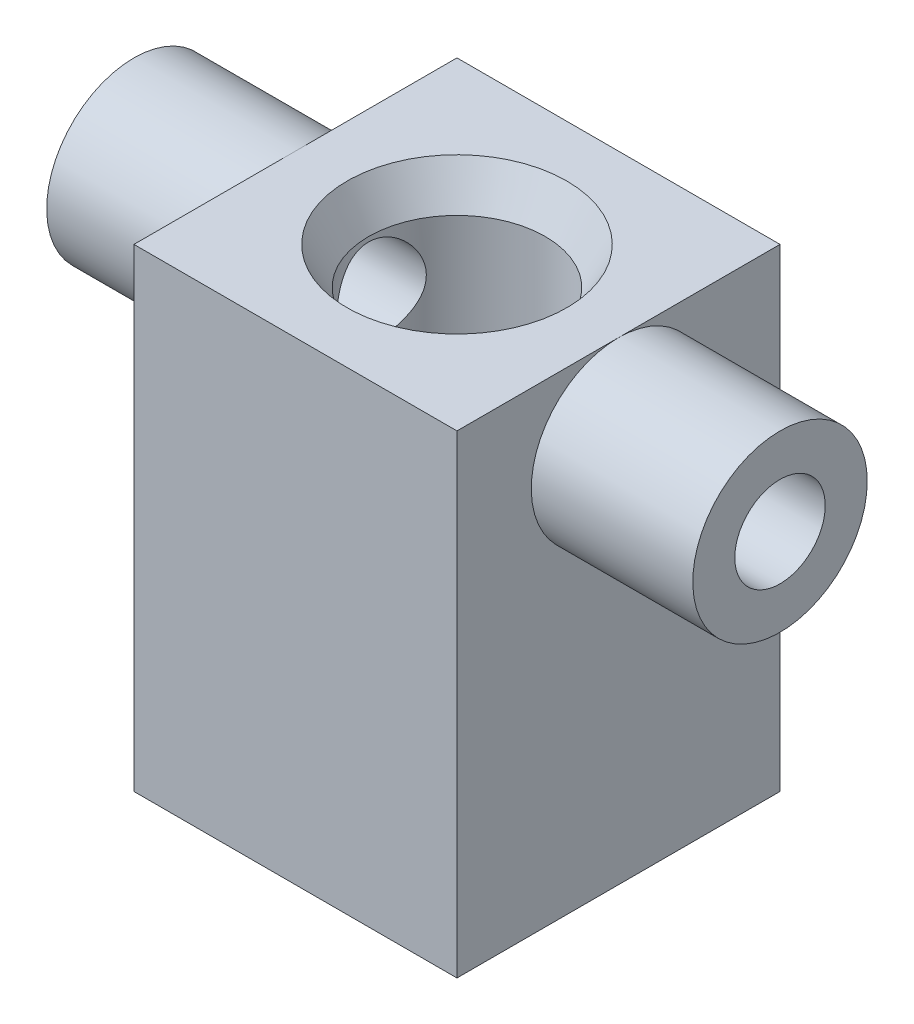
ISO-10303-21;
HEADER;
FILE_DESCRIPTION(('STEP AP214'),'2;1');
FILE_NAME('part.step','',(''),(''),'','','');
FILE_SCHEMA(('AUTOMOTIVE_DESIGN { 1 0 10303 214 1 1 1 1 }'));
ENDSEC;
DATA;
#1=APPLICATION_CONTEXT('core data for automotive mechanical design processes');
#2=APPLICATION_PROTOCOL_DEFINITION('international standard','automotive_design',2000,#1);
#3=PRODUCT_CONTEXT('',#1,'mechanical');
#4=PRODUCT('Part','Part','',(#3));
#5=PRODUCT_RELATED_PRODUCT_CATEGORY('part','',(#4));
#6=PRODUCT_DEFINITION_FORMATION('','',#4);
#7=PRODUCT_DEFINITION_CONTEXT('part definition',#1,'design');
#8=PRODUCT_DEFINITION('design','',#6,#7);
#9=PRODUCT_DEFINITION_SHAPE('','',#8);
#10=(LENGTH_UNIT() NAMED_UNIT(*) SI_UNIT(.MILLI.,.METRE.));
#11=(NAMED_UNIT(*) PLANE_ANGLE_UNIT() SI_UNIT($,.RADIAN.));
#12=(NAMED_UNIT(*) SI_UNIT($,.STERADIAN.) SOLID_ANGLE_UNIT());
#13=UNCERTAINTY_MEASURE_WITH_UNIT(LENGTH_MEASURE(1.E-05),#10,'distance_accuracy_value','');
#14=(GEOMETRIC_REPRESENTATION_CONTEXT(3) GLOBAL_UNCERTAINTY_ASSIGNED_CONTEXT((#13)) GLOBAL_UNIT_ASSIGNED_CONTEXT((#10,
#11,#12)) REPRESENTATION_CONTEXT('',''));
#15=CARTESIAN_POINT('',(0.,0.,0.));
#16=DIRECTION('',(0.,0.,1.));
#17=DIRECTION('',(1.,0.,0.));
#18=AXIS2_PLACEMENT_3D('',#15,#16,#17);
#19=CARTESIAN_POINT('',(7.5,-11.,7.5));
#20=DIRECTION('',(-1.,0.,0.));
#21=DIRECTION('',(0.,0.,1.));
#22=AXIS2_PLACEMENT_3D('',#19,#20,#21);
#23=PLANE('',#22);
#24=DIRECTION('',(0.,0.,-1.));
#25=VECTOR('',#24,1.);
#26=CARTESIAN_POINT('',(7.5,11.,7.5));
#27=LINE('',#26,#25);
#28=CARTESIAN_POINT('',(7.5,11.,0.));
#29=VERTEX_POINT('',#28);
#30=CARTESIAN_POINT('',(7.5,11.,-7.5));
#31=VERTEX_POINT('',#30);
#32=EDGE_CURVE('E96',#29,#31,#27,.T.);
#33=ORIENTED_EDGE('',*,*,#32,.F.);
#34=CARTESIAN_POINT('',(7.5,6.95,0.));
#35=DIRECTION('',(-1.,0.,0.));
#36=DIRECTION('',(0.,0.,1.));
#37=AXIS2_PLACEMENT_3D('',#34,#35,#36);
#38=CIRCLE('',#37,4.05);
#39=EDGE_CURVE('E185',#29,#29,#38,.F.);
#40=ORIENTED_EDGE('',*,*,#39,.F.);
#41=CARTESIAN_POINT('',(7.5,11.,7.5));
#42=VERTEX_POINT('',#41);
#43=EDGE_CURVE('E108',#42,#29,#27,.T.);
#44=ORIENTED_EDGE('',*,*,#43,.F.);
#45=DIRECTION('',(0.,1.,0.));
#46=VECTOR('',#45,1.);
#47=CARTESIAN_POINT('',(7.5,-11.,7.5));
#48=LINE('',#47,#46);
#49=CARTESIAN_POINT('',(7.5,-11.,7.5));
#50=VERTEX_POINT('',#49);
#51=EDGE_CURVE('E197',#50,#42,#48,.T.);
#52=ORIENTED_EDGE('',*,*,#51,.F.);
#53=DIRECTION('',(0.,0.,-1.));
#54=VECTOR('',#53,1.);
#55=CARTESIAN_POINT('',(7.5,-11.,7.5));
#56=LINE('',#55,#54);
#57=CARTESIAN_POINT('',(7.5,-11.,-7.5));
#58=VERTEX_POINT('',#57);
#59=EDGE_CURVE('E104',#50,#58,#56,.T.);
#60=ORIENTED_EDGE('',*,*,#59,.T.);
#61=DIRECTION('',(0.,1.,0.));
#62=VECTOR('',#61,1.);
#63=CARTESIAN_POINT('',(7.5,-11.,-7.5));
#64=LINE('',#63,#62);
#65=EDGE_CURVE('E189',#58,#31,#64,.T.);
#66=ORIENTED_EDGE('',*,*,#65,.T.);
#67=EDGE_LOOP('',(#33,#40,#44,#52,#60,#66));
#68=FACE_BOUND('',#67,.T.);
#69=ADVANCED_FACE('F35',(#68),#23,.F.);
#70=CARTESIAN_POINT('',(-7.5,11.,7.5));
#71=DIRECTION('',(0.,-1.,0.));
#72=DIRECTION('',(0.,0.,-1.));
#73=AXIS2_PLACEMENT_3D('',#70,#71,#72);
#74=PLANE('',#73);
#75=CARTESIAN_POINT('',(0.,11.,0.));
#76=DIRECTION('',(0.,-1.,0.));
#77=DIRECTION('',(0.,0.,-1.));
#78=AXIS2_PLACEMENT_3D('',#75,#76,#77);
#79=CIRCLE('',#78,5.09999999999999);
#80=CARTESIAN_POINT('',(0.,11.,-5.09999999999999));
#81=VERTEX_POINT('',#80);
#82=EDGE_CURVE('E11',#81,#81,#79,.T.);
#83=ORIENTED_EDGE('',*,*,#82,.T.);
#84=EDGE_LOOP('',(#83));
#85=FACE_BOUND('',#84,.T.);
#86=DIRECTION('',(0.,0.,-1.));
#87=VECTOR('',#86,1.);
#88=CARTESIAN_POINT('',(-7.5,11.,7.5));
#89=LINE('',#88,#87);
#90=CARTESIAN_POINT('',(-7.5,11.,0.));
#91=VERTEX_POINT('',#90);
#92=CARTESIAN_POINT('',(-7.5,11.,-7.5));
#93=VERTEX_POINT('',#92);
#94=EDGE_CURVE('E97',#91,#93,#89,.T.);
#95=ORIENTED_EDGE('',*,*,#94,.F.);
#96=CARTESIAN_POINT('',(-7.5,11.,7.5));
#97=VERTEX_POINT('',#96);
#98=EDGE_CURVE('E90',#97,#91,#89,.T.);
#99=ORIENTED_EDGE('',*,*,#98,.F.);
#100=DIRECTION('',(-1.,0.,0.));
#101=VECTOR('',#100,1.);
#102=CARTESIAN_POINT('',(-7.5,11.,7.5));
#103=LINE('',#102,#101);
#104=EDGE_CURVE('E83',#42,#97,#103,.T.);
#105=ORIENTED_EDGE('',*,*,#104,.F.);
#106=ORIENTED_EDGE('',*,*,#43,.T.);
#107=ORIENTED_EDGE('',*,*,#32,.T.);
#108=DIRECTION('',(-1.,0.,0.));
#109=VECTOR('',#108,1.);
#110=CARTESIAN_POINT('',(-7.5,11.,-7.5));
#111=LINE('',#110,#109);
#112=EDGE_CURVE('E102',#31,#93,#111,.T.);
#113=ORIENTED_EDGE('',*,*,#112,.T.);
#114=EDGE_LOOP('',(#95,#99,#105,#106,#107,#113));
#115=FACE_BOUND('',#114,.T.);
#116=ADVANCED_FACE('F100',(#85,#115),#74,.F.);
#117=CARTESIAN_POINT('',(-7.5,-11.,7.5));
#118=DIRECTION('',(1.,0.,0.));
#119=DIRECTION('',(0.,0.,-1.));
#120=AXIS2_PLACEMENT_3D('',#117,#118,#119);
#121=PLANE('',#120);
#122=ORIENTED_EDGE('',*,*,#98,.T.);
#123=CARTESIAN_POINT('',(-7.5,6.95,0.));
#124=DIRECTION('',(1.,0.,0.));
#125=DIRECTION('',(0.,0.,-1.));
#126=AXIS2_PLACEMENT_3D('',#123,#124,#125);
#127=CIRCLE('',#126,4.05);
#128=EDGE_CURVE('E94',#91,#91,#127,.F.);
#129=ORIENTED_EDGE('',*,*,#128,.F.);
#130=ORIENTED_EDGE('',*,*,#94,.T.);
#131=DIRECTION('',(0.,-1.,0.));
#132=VECTOR('',#131,1.);
#133=CARTESIAN_POINT('',(-7.5,-11.,-7.5));
#134=LINE('',#133,#132);
#135=CARTESIAN_POINT('',(-7.5,-11.,-7.5));
#136=VERTEX_POINT('',#135);
#137=EDGE_CURVE('E69',#93,#136,#134,.T.);
#138=ORIENTED_EDGE('',*,*,#137,.T.);
#139=DIRECTION('',(0.,0.,-1.));
#140=VECTOR('',#139,1.);
#141=CARTESIAN_POINT('',(-7.5,-11.,7.5));
#142=LINE('',#141,#140);
#143=CARTESIAN_POINT('',(-7.5,-11.,7.5));
#144=VERTEX_POINT('',#143);
#145=EDGE_CURVE('E103',#144,#136,#142,.T.);
#146=ORIENTED_EDGE('',*,*,#145,.F.);
#147=DIRECTION('',(0.,-1.,0.));
#148=VECTOR('',#147,1.);
#149=CARTESIAN_POINT('',(-7.5,-11.,7.5));
#150=LINE('',#149,#148);
#151=EDGE_CURVE('E95',#97,#144,#150,.T.);
#152=ORIENTED_EDGE('',*,*,#151,.F.);
#153=EDGE_LOOP('',(#122,#129,#130,#138,#146,#152));
#154=FACE_BOUND('',#153,.T.);
#155=ADVANCED_FACE('F92',(#154),#121,.F.);
#156=CARTESIAN_POINT('',(-7.5,-11.,7.5));
#157=DIRECTION('',(0.,1.,0.));
#158=DIRECTION('',(0.,0.,1.));
#159=AXIS2_PLACEMENT_3D('',#156,#157,#158);
#160=PLANE('',#159);
#161=CARTESIAN_POINT('',(0.,-11.,0.));
#162=DIRECTION('',(0.,1.,0.));
#163=DIRECTION('',(0.,0.,1.));
#164=AXIS2_PLACEMENT_3D('',#161,#162,#163);
#165=CIRCLE('',#164,5.1);
#166=CARTESIAN_POINT('',(0.,-11.,5.1));
#167=VERTEX_POINT('',#166);
#168=EDGE_CURVE('E111',#167,#167,#165,.T.);
#169=ORIENTED_EDGE('',*,*,#168,.T.);
#170=EDGE_LOOP('',(#169));
#171=FACE_BOUND('',#170,.T.);
#172=DIRECTION('',(1.,0.,0.));
#173=VECTOR('',#172,1.);
#174=CARTESIAN_POINT('',(-7.5,-11.,-7.5));
#175=LINE('',#174,#173);
#176=EDGE_CURVE('E75',#136,#58,#175,.T.);
#177=ORIENTED_EDGE('',*,*,#176,.T.);
#178=ORIENTED_EDGE('',*,*,#59,.F.);
#179=DIRECTION('',(1.,0.,0.));
#180=VECTOR('',#179,1.);
#181=CARTESIAN_POINT('',(-7.5,-11.,7.5));
#182=LINE('',#181,#180);
#183=EDGE_CURVE('E52',#144,#50,#182,.T.);
#184=ORIENTED_EDGE('',*,*,#183,.F.);
#185=ORIENTED_EDGE('',*,*,#145,.T.);
#186=EDGE_LOOP('',(#177,#178,#184,#185));
#187=FACE_BOUND('',#186,.T.);
#188=ADVANCED_FACE('F154',(#171,#187),#160,.F.);
#189=CARTESIAN_POINT('',(0.,0.,7.5));
#190=DIRECTION('',(0.,0.,-1.));
#191=DIRECTION('',(-1.,0.,0.));
#192=AXIS2_PLACEMENT_3D('',#189,#190,#191);
#193=PLANE('',#192);
#194=ORIENTED_EDGE('',*,*,#51,.T.);
#195=ORIENTED_EDGE('',*,*,#104,.T.);
#196=ORIENTED_EDGE('',*,*,#151,.T.);
#197=ORIENTED_EDGE('',*,*,#183,.T.);
#198=EDGE_LOOP('',(#194,#195,#196,#197));
#199=FACE_BOUND('',#198,.T.);
#200=ADVANCED_FACE('F157',(#199),#193,.F.);
#201=CARTESIAN_POINT('',(0.,0.,-7.5));
#202=DIRECTION('',(0.,0.,-1.));
#203=DIRECTION('',(-1.,0.,0.));
#204=AXIS2_PLACEMENT_3D('',#201,#202,#203);
#205=PLANE('',#204);
#206=ORIENTED_EDGE('',*,*,#65,.F.);
#207=ORIENTED_EDGE('',*,*,#176,.F.);
#208=ORIENTED_EDGE('',*,*,#137,.F.);
#209=ORIENTED_EDGE('',*,*,#112,.F.);
#210=EDGE_LOOP('',(#206,#207,#208,#209));
#211=FACE_BOUND('',#210,.T.);
#212=ADVANCED_FACE('F159',(#211),#205,.T.);
#213=CARTESIAN_POINT('',(-15.,6.95,0.));
#214=DIRECTION('',(1.,0.,0.));
#215=DIRECTION('',(0.,0.,-1.));
#216=AXIS2_PLACEMENT_3D('',#213,#214,#215);
#217=PLANE('',#216);
#218=CARTESIAN_POINT('',(-15.,6.95,0.));
#219=DIRECTION('',(-1.,0.,0.));
#220=DIRECTION('',(0.,0.,1.));
#221=AXIS2_PLACEMENT_3D('',#218,#219,#220);
#222=CIRCLE('',#221,2.1);
#223=CARTESIAN_POINT('',(-15.,6.95,2.1));
#224=VERTEX_POINT('',#223);
#225=EDGE_CURVE('E194',#224,#224,#222,.T.);
#226=ORIENTED_EDGE('',*,*,#225,.F.);
#227=EDGE_LOOP('',(#226));
#228=FACE_BOUND('',#227,.T.);
#229=CARTESIAN_POINT('',(-15.,6.95,0.));
#230=DIRECTION('',(1.,0.,0.));
#231=DIRECTION('',(0.,0.,-1.));
#232=AXIS2_PLACEMENT_3D('',#229,#230,#231);
#233=CIRCLE('',#232,4.05);
#234=CARTESIAN_POINT('',(-15.,6.95,-4.05));
#235=VERTEX_POINT('',#234);
#236=EDGE_CURVE('E186',#235,#235,#233,.T.);
#237=ORIENTED_EDGE('',*,*,#236,.F.);
#238=EDGE_LOOP('',(#237));
#239=FACE_BOUND('',#238,.T.);
#240=ADVANCED_FACE('F162',(#228,#239),#217,.F.);
#241=CARTESIAN_POINT('',(15.,6.95,0.));
#242=DIRECTION('',(-1.,0.,0.));
#243=DIRECTION('',(0.,0.,1.));
#244=AXIS2_PLACEMENT_3D('',#241,#242,#243);
#245=CYLINDRICAL_SURFACE('',#244,4.05);
#246=ORIENTED_EDGE('',*,*,#236,.T.);
#247=EDGE_LOOP('',(#246));
#248=FACE_BOUND('',#247,.T.);
#249=ORIENTED_EDGE('',*,*,#128,.T.);
#250=EDGE_LOOP('',(#249));
#251=FACE_BOUND('',#250,.T.);
#252=ADVANCED_FACE('F170',(#248,#251),#245,.T.);
#253=CARTESIAN_POINT('',(15.,6.95,0.));
#254=DIRECTION('',(1.,0.,0.));
#255=DIRECTION('',(0.,0.,-1.));
#256=AXIS2_PLACEMENT_3D('',#253,#254,#255);
#257=CIRCLE('',#256,4.05);
#258=CARTESIAN_POINT('',(15.,6.95,-4.05));
#259=VERTEX_POINT('',#258);
#260=EDGE_CURVE('E184',#259,#259,#257,.T.);
#261=ORIENTED_EDGE('',*,*,#260,.F.);
#262=EDGE_LOOP('',(#261));
#263=FACE_BOUND('',#262,.T.);
#264=ORIENTED_EDGE('',*,*,#39,.T.);
#265=EDGE_LOOP('',(#264));
#266=FACE_BOUND('',#265,.T.);
#267=ADVANCED_FACE('F166',(#263,#266),#245,.T.);
#268=CARTESIAN_POINT('',(15.,6.95,0.));
#269=DIRECTION('',(1.,0.,0.));
#270=DIRECTION('',(0.,0.,-1.));
#271=AXIS2_PLACEMENT_3D('',#268,#269,#270);
#272=PLANE('',#271);
#273=CARTESIAN_POINT('',(15.,6.95,0.));
#274=DIRECTION('',(-1.,0.,0.));
#275=DIRECTION('',(0.,0.,1.));
#276=AXIS2_PLACEMENT_3D('',#273,#274,#275);
#277=CIRCLE('',#276,2.1);
#278=CARTESIAN_POINT('',(15.,6.95,2.1));
#279=VERTEX_POINT('',#278);
#280=EDGE_CURVE('E120',#279,#279,#277,.T.);
#281=ORIENTED_EDGE('',*,*,#280,.T.);
#282=EDGE_LOOP('',(#281));
#283=FACE_BOUND('',#282,.T.);
#284=ORIENTED_EDGE('',*,*,#260,.T.);
#285=EDGE_LOOP('',(#284));
#286=FACE_BOUND('',#285,.T.);
#287=ADVANCED_FACE('F169',(#283,#286),#272,.T.);
#288=CARTESIAN_POINT('',(0.,-11.,0.));
#289=DIRECTION('',(0.,1.,0.));
#290=DIRECTION('',(0.,0.,1.));
#291=AXIS2_PLACEMENT_3D('',#288,#289,#290);
#292=CYLINDRICAL_SURFACE('',#291,4.1);
#293=CARTESIAN_POINT('',(0.,-9.26794919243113,0.));
#294=DIRECTION('',(0.,1.,0.));
#295=DIRECTION('',(0.,0.,1.));
#296=AXIS2_PLACEMENT_3D('',#293,#294,#295);
#297=CIRCLE('',#296,4.1);
#298=CARTESIAN_POINT('',(0.,-9.26794919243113,4.1));
#299=VERTEX_POINT('',#298);
#300=EDGE_CURVE('E44',#299,#299,#297,.F.);
#301=ORIENTED_EDGE('',*,*,#300,.T.);
#302=EDGE_LOOP('',(#301));
#303=FACE_BOUND('',#302,.T.);
#304=CARTESIAN_POINT('',(0.,9.26794919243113,0.));
#305=DIRECTION('',(0.,-1.,0.));
#306=DIRECTION('',(0.,0.,-1.));
#307=AXIS2_PLACEMENT_3D('',#304,#305,#306);
#308=CIRCLE('',#307,4.1);
#309=CARTESIAN_POINT('',(0.,9.26794919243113,-4.1));
#310=VERTEX_POINT('',#309);
#311=EDGE_CURVE('E290',#310,#310,#308,.F.);
#312=ORIENTED_EDGE('',*,*,#311,.T.);
#313=EDGE_LOOP('',(#312));
#314=FACE_BOUND('',#313,.T.);
#315=CARTESIAN_POINT('',(3.5213633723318,6.95,2.1));
#316=CARTESIAN_POINT('',(3.52137486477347,6.84099716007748,2.0999907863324));
#317=CARTESIAN_POINT('',(3.52650292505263,6.73186167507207,2.0914551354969));
#318=CARTESIAN_POINT('',(3.54626250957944,6.51697691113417,2.05776033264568));
#319=CARTESIAN_POINT('',(3.56091302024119,6.41123484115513,2.03256796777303));
#320=CARTESIAN_POINT('',(3.59756539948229,6.20665229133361,1.96695536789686));
#321=CARTESIAN_POINT('',(3.619526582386,6.10777719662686,1.92661925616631));
#322=CARTESIAN_POINT('',(3.66826250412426,5.91822446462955,1.83212125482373));
#323=CARTESIAN_POINT('',(3.6950377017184,5.82754760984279,1.77795804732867));
#324=CARTESIAN_POINT('',(3.75322048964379,5.64828223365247,1.65183522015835));
#325=CARTESIAN_POINT('',(3.78482844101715,5.56055802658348,1.57873901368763));
#326=CARTESIAN_POINT('',(3.84750101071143,5.3979367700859,1.41918479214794));
#327=CARTESIAN_POINT('',(3.87856533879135,5.323046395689,1.33271986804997));
#328=CARTESIAN_POINT('',(3.93930878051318,5.18296254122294,1.14132342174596));
#329=CARTESIAN_POINT('',(3.96872946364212,5.11884727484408,1.03551296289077));
#330=CARTESIAN_POINT('',(4.020242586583,5.00972402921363,0.812817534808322));
#331=CARTESIAN_POINT('',(4.04233987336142,4.96470340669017,0.695939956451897));
#332=CARTESIAN_POINT('',(4.07526773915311,4.89852082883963,0.463597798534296));
#333=CARTESIAN_POINT('',(4.08681150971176,4.87583887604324,0.348669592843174));
#334=CARTESIAN_POINT('',(4.10000620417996,4.84995649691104,0.116105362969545));
#335=CARTESIAN_POINT('',(4.1016634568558,4.84674360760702,-0.00152888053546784));
#336=CARTESIAN_POINT('',(4.09522254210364,4.85933906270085,-0.224674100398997));
#337=CARTESIAN_POINT('',(4.08799978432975,4.8734403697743,-0.330312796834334));
#338=CARTESIAN_POINT('',(4.06595244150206,4.91718779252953,-0.537479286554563));
#339=CARTESIAN_POINT('',(4.0511272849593,4.94683507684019,-0.639006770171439));
#340=CARTESIAN_POINT('',(4.01497709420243,5.02098487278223,-0.83678528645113));
#341=CARTESIAN_POINT('',(3.99356852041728,5.06567905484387,-0.932948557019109));
#342=CARTESIAN_POINT('',(3.9461551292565,5.16836791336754,-1.1166339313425));
#343=CARTESIAN_POINT('',(3.92014869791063,5.22636726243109,-1.20415298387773));
#344=CARTESIAN_POINT('',(3.86294966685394,5.36052955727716,-1.3772132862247));
#345=CARTESIAN_POINT('',(3.83149859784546,5.43791480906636,-1.46172214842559));
#346=CARTESIAN_POINT('',(3.76854382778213,5.60540094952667,-1.61713399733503));
#347=CARTESIAN_POINT('',(3.73704010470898,5.69551234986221,-1.68802562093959));
#348=CARTESIAN_POINT('',(3.67516090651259,5.89347882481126,-1.81901015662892));
#349=CARTESIAN_POINT('',(3.64501352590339,6.00212944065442,-1.87801947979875));
#350=CARTESIAN_POINT('',(3.59258283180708,6.2296975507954,-1.97648423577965));
#351=CARTESIAN_POINT('',(3.57029101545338,6.3486037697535,-2.0159608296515));
#352=CARTESIAN_POINT('',(3.53865395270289,6.58330689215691,-2.0709580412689));
#353=CARTESIAN_POINT('',(3.52841295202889,6.69858695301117,-2.08814755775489));
#354=CARTESIAN_POINT('',(3.51951059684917,6.93080924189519,-2.10312595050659));
#355=CARTESIAN_POINT('',(3.52084007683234,7.04775008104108,-2.10093018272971));
#356=CARTESIAN_POINT('',(3.53397624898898,7.2652896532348,-2.07873216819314));
#357=CARTESIAN_POINT('',(3.54453306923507,7.36619361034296,-2.06085325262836));
#358=CARTESIAN_POINT('',(3.5730489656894,7.56335678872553,-2.01100455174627));
#359=CARTESIAN_POINT('',(3.59101059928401,7.65961439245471,-1.9790298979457));
#360=CARTESIAN_POINT('',(3.63326773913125,7.84980059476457,-1.9003779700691));
#361=CARTESIAN_POINT('',(3.65781605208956,7.94341967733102,-1.85309340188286));
#362=CARTESIAN_POINT('',(3.71027714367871,8.12194342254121,-1.74568453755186));
#363=CARTESIAN_POINT('',(3.73819165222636,8.20684356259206,-1.68555362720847));
#364=CARTESIAN_POINT('',(3.79871810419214,8.37739001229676,-1.544783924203));
#365=CARTESIAN_POINT('',(3.83145947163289,8.46162135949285,-1.46247870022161));
#366=CARTESIAN_POINT('',(3.89475703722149,8.61555058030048,-1.28444293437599));
#367=CARTESIAN_POINT('',(3.92531237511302,8.68524275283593,-1.18870715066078));
#368=CARTESIAN_POINT('',(3.98202463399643,8.81002938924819,-0.982474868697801));
#369=CARTESIAN_POINT('',(4.00801257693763,8.86459454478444,-0.871608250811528));
#370=CARTESIAN_POINT('',(4.05135230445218,8.95374212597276,-0.640555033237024));
#371=CARTESIAN_POINT('',(4.06871203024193,8.98834293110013,-0.520377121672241));
#372=CARTESIAN_POINT('',(4.09151417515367,9.03346452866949,-0.286370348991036));
#373=CARTESIAN_POINT('',(4.09792788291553,9.04595215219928,-0.17301496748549));
#374=CARTESIAN_POINT('',(4.10121332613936,9.05237091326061,0.0543412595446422));
#375=CARTESIAN_POINT('',(4.09808875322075,9.04630922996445,0.168341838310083));
#376=CARTESIAN_POINT('',(4.08321190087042,9.01706473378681,0.385174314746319));
#377=CARTESIAN_POINT('',(4.07209041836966,8.99513299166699,0.488223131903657));
#378=CARTESIAN_POINT('',(4.0429677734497,8.93651300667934,0.6889899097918));
#379=CARTESIAN_POINT('',(4.02496566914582,8.89982274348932,0.786707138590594));
#380=CARTESIAN_POINT('',(3.98276605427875,8.81118364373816,0.978582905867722));
#381=CARTESIAN_POINT('',(3.95834376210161,8.75866820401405,1.07242873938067));
#382=CARTESIAN_POINT('',(3.90579632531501,8.64057447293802,1.2503499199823));
#383=CARTESIAN_POINT('',(3.87766950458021,8.57499026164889,1.33442081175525));
#384=CARTESIAN_POINT('',(3.81702576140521,8.4247485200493,1.4996115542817));
#385=CARTESIAN_POINT('',(3.78435601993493,8.33881848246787,1.57952177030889));
#386=CARTESIAN_POINT('',(3.72063953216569,8.15443396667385,1.72427026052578));
#387=CARTESIAN_POINT('',(3.68959436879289,8.0559675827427,1.78909403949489));
#388=CARTESIAN_POINT('',(3.63163236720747,7.8441250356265,1.90409524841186));
#389=CARTESIAN_POINT('',(3.60492589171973,7.73031481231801,1.95359644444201));
#390=CARTESIAN_POINT('',(3.57221853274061,7.55342245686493,2.01239883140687));
#391=CARTESIAN_POINT('',(3.56254683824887,7.4934851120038,2.02941640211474));
#392=CARTESIAN_POINT('',(3.54604777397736,7.37197714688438,2.05811129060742));
#393=CARTESIAN_POINT('',(3.53921845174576,7.31040767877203,2.06979227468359));
#394=CARTESIAN_POINT('',(3.52981733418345,7.19904246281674,2.08577480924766));
#395=CARTESIAN_POINT('',(3.52665758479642,7.1494408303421,2.09110209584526));
#396=CARTESIAN_POINT('',(3.522427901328,7.04990210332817,2.0982169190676));
#397=CARTESIAN_POINT('',(3.52135810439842,6.99996498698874,2.10000422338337));
#398=CARTESIAN_POINT('',(3.5213633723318,6.95,2.1));
#399=B_SPLINE_CURVE_WITH_KNOTS('',3,(#315,#316,#317,#318,#319,#320,#321,#322,#323,#324,#325,
#326,#327,#328,#329,#330,#331,#332,#333,#334,#335,#336,#337,#338,#339,#340,#341,#342,#343,#344,
#345,#346,#347,#348,#349,#350,#351,#352,#353,#354,#355,#356,#357,#358,#359,#360,#361,#362,#363,
#364,#365,#366,#367,#368,#369,#370,#371,#372,#373,#374,#375,#376,#377,#378,#379,#380,#381,#382,
#383,#384,#385,#386,#387,#388,#389,#390,#391,#392,#393,#394,#395,#396,#397,#398),.UNSPECIFIED.,
.T.,.F.,(4,2,2,2,2,2,2,2,2,2,2,2,2,2,2,2,2,2,2,2,2,2,2,2,2,2,2,2,2,2,2,2,2,2,2,2,2,2,2,2,2,4),
(0.,0.326805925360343,0.654265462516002,0.979932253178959,1.30563009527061,1.6595960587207,
2.0137455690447,2.39325194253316,2.77250663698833,3.12367466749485,3.47461787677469,
3.79357364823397,4.11255339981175,4.43576062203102,4.7590815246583,5.11405456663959,
5.46932254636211,5.84912063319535,6.2285063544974,6.57743208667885,6.92608144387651,
7.23375014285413,7.5415251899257,7.86342209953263,8.18548514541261,8.55056511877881,
8.91578797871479,9.2925216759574,9.6689079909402,10.0097201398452,10.3504004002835,
10.6667992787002,10.983241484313,11.31272704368,11.6423621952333,12.006173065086,
12.3703320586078,12.7488119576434,12.9377147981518,13.1264876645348,13.2762799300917,
13.4260820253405),.UNSPECIFIED.);
#400=CARTESIAN_POINT('',(3.5213633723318,6.95,2.1));
#401=VERTEX_POINT('',#400);
#402=EDGE_CURVE('E119',#401,#401,#399,.T.);
#403=ORIENTED_EDGE('',*,*,#402,.T.);
#404=EDGE_LOOP('',(#403));
#405=FACE_BOUND('',#404,.T.);
#406=CARTESIAN_POINT('',(-3.5213633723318,6.95,2.1));
#407=CARTESIAN_POINT('',(-3.52137486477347,7.05900283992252,2.0999907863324));
#408=CARTESIAN_POINT('',(-3.52650292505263,7.16813832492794,2.0914551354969));
#409=CARTESIAN_POINT('',(-3.54626250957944,7.38302308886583,2.05776033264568));
#410=CARTESIAN_POINT('',(-3.56091302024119,7.48876515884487,2.03256796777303));
#411=CARTESIAN_POINT('',(-3.59756539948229,7.69334770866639,1.96695536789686));
#412=CARTESIAN_POINT('',(-3.619526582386,7.79222280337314,1.92661925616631));
#413=CARTESIAN_POINT('',(-3.66826250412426,7.98177553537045,1.83212125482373));
#414=CARTESIAN_POINT('',(-3.6950377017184,8.07245239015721,1.77795804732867));
#415=CARTESIAN_POINT('',(-3.75322048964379,8.25171776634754,1.65183522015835));
#416=CARTESIAN_POINT('',(-3.78482844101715,8.33944197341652,1.57873901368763));
#417=CARTESIAN_POINT('',(-3.84750101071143,8.5020632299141,1.41918479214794));
#418=CARTESIAN_POINT('',(-3.87856533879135,8.57695360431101,1.33271986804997));
#419=CARTESIAN_POINT('',(-3.93930878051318,8.71703745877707,1.14132342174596));
#420=CARTESIAN_POINT('',(-3.96872946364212,8.78115272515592,1.03551296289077));
#421=CARTESIAN_POINT('',(-4.020242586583,8.89027597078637,0.812817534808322));
#422=CARTESIAN_POINT('',(-4.04233987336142,8.93529659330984,0.695939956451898));
#423=CARTESIAN_POINT('',(-4.07526773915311,9.00147917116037,0.463597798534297));
#424=CARTESIAN_POINT('',(-4.08681150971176,9.02416112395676,0.348669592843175));
#425=CARTESIAN_POINT('',(-4.10000620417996,9.05004350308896,0.116105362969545));
#426=CARTESIAN_POINT('',(-4.1016634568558,9.05325639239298,-0.00152888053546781));
#427=CARTESIAN_POINT('',(-4.09522254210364,9.04066093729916,-0.224674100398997));
#428=CARTESIAN_POINT('',(-4.08799978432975,9.02655963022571,-0.330312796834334));
#429=CARTESIAN_POINT('',(-4.06595244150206,8.98281220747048,-0.537479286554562));
#430=CARTESIAN_POINT('',(-4.0511272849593,8.95316492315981,-0.639006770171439));
#431=CARTESIAN_POINT('',(-4.01497709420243,8.87901512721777,-0.836785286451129));
#432=CARTESIAN_POINT('',(-3.99356852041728,8.83432094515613,-0.932948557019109));
#433=CARTESIAN_POINT('',(-3.9461551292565,8.73163208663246,-1.1166339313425));
#434=CARTESIAN_POINT('',(-3.92014869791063,8.67363273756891,-1.20415298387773));
#435=CARTESIAN_POINT('',(-3.86294966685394,8.53947044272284,-1.3772132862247));
#436=CARTESIAN_POINT('',(-3.83149859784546,8.46208519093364,-1.46172214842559));
#437=CARTESIAN_POINT('',(-3.76854382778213,8.29459905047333,-1.61713399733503));
#438=CARTESIAN_POINT('',(-3.73704010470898,8.2044876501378,-1.68802562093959));
#439=CARTESIAN_POINT('',(-3.67516090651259,8.00652117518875,-1.81901015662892));
#440=CARTESIAN_POINT('',(-3.64501352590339,7.89787055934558,-1.87801947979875));
#441=CARTESIAN_POINT('',(-3.59258283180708,7.67030244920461,-1.97648423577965));
#442=CARTESIAN_POINT('',(-3.57029101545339,7.55139623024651,-2.0159608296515));
#443=CARTESIAN_POINT('',(-3.53865395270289,7.3166931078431,-2.0709580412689));
#444=CARTESIAN_POINT('',(-3.52841295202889,7.20141304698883,-2.08814755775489));
#445=CARTESIAN_POINT('',(-3.51951059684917,6.96919075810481,-2.10312595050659));
#446=CARTESIAN_POINT('',(-3.52084007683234,6.85224991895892,-2.10093018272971));
#447=CARTESIAN_POINT('',(-3.53397624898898,6.6347103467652,-2.07873216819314));
#448=CARTESIAN_POINT('',(-3.54453306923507,6.53380638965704,-2.06085325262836));
#449=CARTESIAN_POINT('',(-3.5730489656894,6.33664321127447,-2.01100455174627));
#450=CARTESIAN_POINT('',(-3.59101059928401,6.24038560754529,-1.9790298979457));
#451=CARTESIAN_POINT('',(-3.63326773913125,6.05019940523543,-1.9003779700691));
#452=CARTESIAN_POINT('',(-3.65781605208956,5.95658032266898,-1.85309340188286));
#453=CARTESIAN_POINT('',(-3.71027714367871,5.77805657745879,-1.74568453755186));
#454=CARTESIAN_POINT('',(-3.73819165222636,5.69315643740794,-1.68555362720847));
#455=CARTESIAN_POINT('',(-3.79871810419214,5.52260998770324,-1.544783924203));
#456=CARTESIAN_POINT('',(-3.83145947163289,5.43837864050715,-1.46247870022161));
#457=CARTESIAN_POINT('',(-3.89475703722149,5.28444941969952,-1.28444293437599));
#458=CARTESIAN_POINT('',(-3.92531237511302,5.21475724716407,-1.18870715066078));
#459=CARTESIAN_POINT('',(-3.98202463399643,5.08997061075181,-0.982474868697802));
#460=CARTESIAN_POINT('',(-4.00801257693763,5.03540545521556,-0.871608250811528));
#461=CARTESIAN_POINT('',(-4.05135230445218,4.94625787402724,-0.640555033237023));
#462=CARTESIAN_POINT('',(-4.06871203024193,4.91165706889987,-0.520377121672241));
#463=CARTESIAN_POINT('',(-4.09151417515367,4.86653547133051,-0.286370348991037));
#464=CARTESIAN_POINT('',(-4.09792788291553,4.85404784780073,-0.17301496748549));
#465=CARTESIAN_POINT('',(-4.10121332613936,4.84762908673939,0.054341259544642));
#466=CARTESIAN_POINT('',(-4.09808875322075,4.85369077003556,0.168341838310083));
#467=CARTESIAN_POINT('',(-4.08321190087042,4.8829352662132,0.385174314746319));
#468=CARTESIAN_POINT('',(-4.07209041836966,4.90486700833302,0.488223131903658));
#469=CARTESIAN_POINT('',(-4.0429677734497,4.96348699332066,0.688989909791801));
#470=CARTESIAN_POINT('',(-4.02496566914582,5.00017725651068,0.786707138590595));
#471=CARTESIAN_POINT('',(-3.98276605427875,5.08881635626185,0.978582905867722));
#472=CARTESIAN_POINT('',(-3.95834376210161,5.14133179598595,1.07242873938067));
#473=CARTESIAN_POINT('',(-3.90579632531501,5.25942552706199,1.2503499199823));
#474=CARTESIAN_POINT('',(-3.87766950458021,5.32500973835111,1.33442081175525));
#475=CARTESIAN_POINT('',(-3.81702576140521,5.4752514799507,1.4996115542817));
#476=CARTESIAN_POINT('',(-3.78435601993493,5.56118151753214,1.57952177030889));
#477=CARTESIAN_POINT('',(-3.72063953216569,5.74556603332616,1.72427026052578));
#478=CARTESIAN_POINT('',(-3.68959436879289,5.8440324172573,1.78909403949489));
#479=CARTESIAN_POINT('',(-3.63163236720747,6.0558749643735,1.90409524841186));
#480=CARTESIAN_POINT('',(-3.60492589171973,6.16968518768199,1.95359644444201));
#481=CARTESIAN_POINT('',(-3.57221853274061,6.34657754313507,2.01239883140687));
#482=CARTESIAN_POINT('',(-3.56254683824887,6.4065148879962,2.02941640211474));
#483=CARTESIAN_POINT('',(-3.54604777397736,6.52802285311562,2.05811129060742));
#484=CARTESIAN_POINT('',(-3.53921845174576,6.58959232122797,2.06979227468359));
#485=CARTESIAN_POINT('',(-3.52981733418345,6.70095753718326,2.08577480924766));
#486=CARTESIAN_POINT('',(-3.52665758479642,6.7505591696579,2.09110209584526));
#487=CARTESIAN_POINT('',(-3.522427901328,6.85009789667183,2.0982169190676));
#488=CARTESIAN_POINT('',(-3.52135810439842,6.90003501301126,2.10000422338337));
#489=CARTESIAN_POINT('',(-3.5213633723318,6.95,2.1));
#490=B_SPLINE_CURVE_WITH_KNOTS('',3,(#406,#407,#408,#409,#410,#411,#412,#413,#414,#415,#416,
#417,#418,#419,#420,#421,#422,#423,#424,#425,#426,#427,#428,#429,#430,#431,#432,#433,#434,#435,
#436,#437,#438,#439,#440,#441,#442,#443,#444,#445,#446,#447,#448,#449,#450,#451,#452,#453,#454,
#455,#456,#457,#458,#459,#460,#461,#462,#463,#464,#465,#466,#467,#468,#469,#470,#471,#472,#473,
#474,#475,#476,#477,#478,#479,#480,#481,#482,#483,#484,#485,#486,#487,#488,#489),.UNSPECIFIED.,
.T.,.F.,(4,2,2,2,2,2,2,2,2,2,2,2,2,2,2,2,2,2,2,2,2,2,2,2,2,2,2,2,2,2,2,2,2,2,2,2,2,2,2,2,2,4),
(0.,0.326805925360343,0.654265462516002,0.979932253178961,1.30563009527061,1.6595960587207,
2.0137455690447,2.39325194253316,2.77250663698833,3.12367466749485,3.47461787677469,
3.79357364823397,4.11255339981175,4.43576062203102,4.7590815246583,5.11405456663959,
5.46932254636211,5.84912063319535,6.2285063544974,6.57743208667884,6.92608144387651,
7.23375014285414,7.5415251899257,7.86342209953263,8.18548514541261,8.55056511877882,
8.91578797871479,9.2925216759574,9.66890799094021,10.0097201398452,10.3504004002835,
10.6667992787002,10.983241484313,11.31272704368,11.6423621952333,12.006173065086,
12.3703320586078,12.7488119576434,12.9377147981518,13.1264876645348,13.2762799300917,
13.4260820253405),.UNSPECIFIED.);
#491=CARTESIAN_POINT('',(-3.5213633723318,6.95,2.1));
#492=VERTEX_POINT('',#491);
#493=EDGE_CURVE('E112',#492,#492,#490,.T.);
#494=ORIENTED_EDGE('',*,*,#493,.T.);
#495=EDGE_LOOP('',(#494));
#496=FACE_BOUND('',#495,.T.);
#497=ADVANCED_FACE('F124',(#303,#314,#405,#496),#292,.F.);
#498=CARTESIAN_POINT('',(15.,6.95,0.));
#499=DIRECTION('',(-1.,0.,0.));
#500=DIRECTION('',(0.,0.,1.));
#501=AXIS2_PLACEMENT_3D('',#498,#499,#500);
#502=CYLINDRICAL_SURFACE('',#501,2.1);
#503=ORIENTED_EDGE('',*,*,#225,.T.);
#504=EDGE_LOOP('',(#503));
#505=FACE_BOUND('',#504,.T.);
#506=ORIENTED_EDGE('',*,*,#493,.F.);
#507=EDGE_LOOP('',(#506));
#508=FACE_BOUND('',#507,.T.);
#509=ADVANCED_FACE('F131',(#505,#508),#502,.F.);
#510=ORIENTED_EDGE('',*,*,#280,.F.);
#511=EDGE_LOOP('',(#510));
#512=FACE_BOUND('',#511,.T.);
#513=ORIENTED_EDGE('',*,*,#402,.F.);
#514=EDGE_LOOP('',(#513));
#515=FACE_BOUND('',#514,.T.);
#516=ADVANCED_FACE('F127',(#512,#515),#502,.F.);
#517=CARTESIAN_POINT('',(0.,-11.,0.));
#518=DIRECTION('',(0.,-1.,0.));
#519=DIRECTION('',(0.,0.,-1.));
#520=AXIS2_PLACEMENT_3D('',#517,#518,#519);
#521=CONICAL_SURFACE('',#520,5.1,0.523598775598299);
#522=ORIENTED_EDGE('',*,*,#300,.F.);
#523=EDGE_LOOP('',(#522));
#524=FACE_BOUND('',#523,.T.);
#525=ORIENTED_EDGE('',*,*,#168,.F.);
#526=EDGE_LOOP('',(#525));
#527=FACE_BOUND('',#526,.T.);
#528=ADVANCED_FACE('F130',(#524,#527),#521,.F.);
#529=CARTESIAN_POINT('',(0.,9.26794919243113,0.));
#530=DIRECTION('',(0.,1.,0.));
#531=DIRECTION('',(0.,0.,1.));
#532=AXIS2_PLACEMENT_3D('',#529,#530,#531);
#533=CONICAL_SURFACE('',#532,4.1,0.523598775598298);
#534=ORIENTED_EDGE('',*,*,#82,.F.);
#535=EDGE_LOOP('',(#534));
#536=FACE_BOUND('',#535,.T.);
#537=ORIENTED_EDGE('',*,*,#311,.F.);
#538=EDGE_LOOP('',(#537));
#539=FACE_BOUND('',#538,.T.);
#540=ADVANCED_FACE('F37',(#536,#539),#533,.F.);
#541=CLOSED_SHELL('',(#69,#116,#155,#188,#200,#212,#240,#252,#267,#287,#497,#509,#516,#528,#540));
#542=MANIFOLD_SOLID_BREP('B2',#541);
#543=ADVANCED_BREP_SHAPE_REPRESENTATION('',(#18,#542),#14);
#544=SHAPE_DEFINITION_REPRESENTATION(#9,#543);
ENDSEC;
END-ISO-10303-21;
